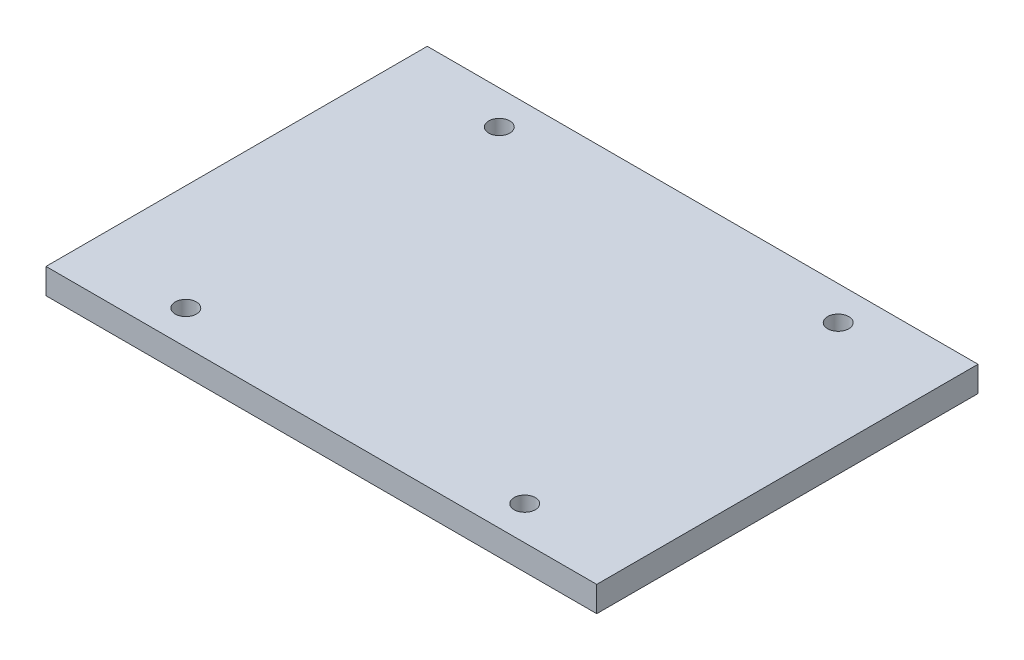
from build123d import *

# Parameters (mm, degrees)
SKETCH1_W           = 65
SKETCH1_H           = 45
SKETCH1_R           = 1.25
BOSS_EXTRUDE1_DEPTH = 3


with BuildPart() as part:
    # Sketch1 → Boss-Extrude1 (new body)
    with BuildSketch(Plane(origin=(0, 0, 0), x_dir=(1, 0, 0), z_dir=(0, 1, 0))):
        Rectangle(SKETCH1_W, SKETCH1_H)
        with Locations(Location((-20, 18.5, 0), (0, 0, 270))):
            Circle(SKETCH1_R, mode=Mode.SUBTRACT)
        with Locations(Location((-20, -18.5, 0), (0, 0, 270))):
            Circle(SKETCH1_R, mode=Mode.SUBTRACT)
        with Locations(Location((20, -18.5, 0), (0, 0, 270))):
            Circle(SKETCH1_R, mode=Mode.SUBTRACT)
        with Locations(Location((20, 18.5, 0), (0, 0, 270))):
            Circle(SKETCH1_R, mode=Mode.SUBTRACT)
    extrude(amount=BOSS_EXTRUDE1_DEPTH)


solid = part.part
